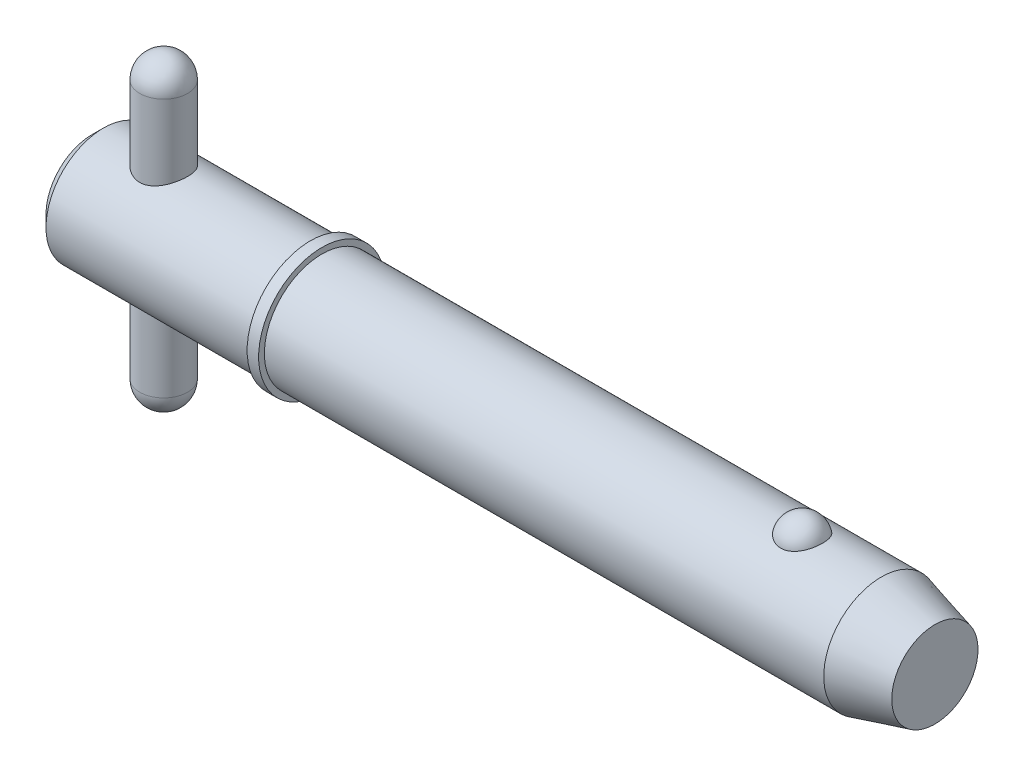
ISO-10303-21;
HEADER;
FILE_DESCRIPTION(('STEP AP214'),'2;1');
FILE_NAME('part.step','',(''),(''),'','','');
FILE_SCHEMA(('AUTOMOTIVE_DESIGN { 1 0 10303 214 1 1 1 1 }'));
ENDSEC;
DATA;
#1=APPLICATION_CONTEXT('core data for automotive mechanical design processes');
#2=APPLICATION_PROTOCOL_DEFINITION('international standard','automotive_design',2000,#1);
#3=PRODUCT_CONTEXT('',#1,'mechanical');
#4=PRODUCT('Part','Part','',(#3));
#5=PRODUCT_RELATED_PRODUCT_CATEGORY('part','',(#4));
#6=PRODUCT_DEFINITION_FORMATION('','',#4);
#7=PRODUCT_DEFINITION_CONTEXT('part definition',#1,'design');
#8=PRODUCT_DEFINITION('design','',#6,#7);
#9=PRODUCT_DEFINITION_SHAPE('','',#8);
#10=(LENGTH_UNIT() NAMED_UNIT(*) SI_UNIT(.MILLI.,.METRE.));
#11=(NAMED_UNIT(*) PLANE_ANGLE_UNIT() SI_UNIT($,.RADIAN.));
#12=(NAMED_UNIT(*) SI_UNIT($,.STERADIAN.) SOLID_ANGLE_UNIT());
#13=UNCERTAINTY_MEASURE_WITH_UNIT(LENGTH_MEASURE(1.E-05),#10,'distance_accuracy_value','');
#14=(GEOMETRIC_REPRESENTATION_CONTEXT(3) GLOBAL_UNCERTAINTY_ASSIGNED_CONTEXT((#13)) GLOBAL_UNIT_ASSIGNED_CONTEXT((#10,
#11,#12)) REPRESENTATION_CONTEXT('',''));
#15=CARTESIAN_POINT('',(0.,0.,0.));
#16=DIRECTION('',(0.,0.,1.));
#17=DIRECTION('',(1.,0.,0.));
#18=AXIS2_PLACEMENT_3D('',#15,#16,#17);
#19=CARTESIAN_POINT('',(5.94,12.7,0.));
#20=DIRECTION('',(0.,-1.,0.));
#21=DIRECTION('',(0.,0.,-1.));
#22=AXIS2_PLACEMENT_3D('',#19,#20,#21);
#23=CYLINDRICAL_SURFACE('',#22,1.98);
#24=CARTESIAN_POINT('',(5.94,-10.72,0.));
#25=DIRECTION('',(0.,-1.,0.));
#26=DIRECTION('',(0.,0.,-1.));
#27=AXIS2_PLACEMENT_3D('',#24,#25,#26);
#28=CIRCLE('',#27,1.98);
#29=CARTESIAN_POINT('',(5.94,-10.72,-1.98));
#30=VERTEX_POINT('',#29);
#31=EDGE_CURVE('P0_E10',#30,#30,#28,.F.);
#32=ORIENTED_EDGE('',*,*,#31,.T.);
#33=EDGE_LOOP('',(#32));
#34=FACE_BOUND('',#33,.T.);
#35=CARTESIAN_POINT('',(5.94,10.72,0.));
#36=DIRECTION('',(0.,-1.,0.));
#37=DIRECTION('',(0.,0.,-1.));
#38=AXIS2_PLACEMENT_3D('',#35,#36,#37);
#39=CIRCLE('',#38,1.98);
#40=CARTESIAN_POINT('',(5.94,10.72,-1.98));
#41=VERTEX_POINT('',#40);
#42=EDGE_CURVE('P0_E21',#41,#41,#39,.T.);
#43=ORIENTED_EDGE('',*,*,#42,.T.);
#44=EDGE_LOOP('',(#43));
#45=FACE_BOUND('',#44,.T.);
#46=ADVANCED_FACE('P0_F14',(#34,#45),#23,.T.);
#47=CARTESIAN_POINT('',(5.94,-10.72,0.));
#48=DIRECTION('',(0.,0.,1.));
#49=DIRECTION('',(1.,0.,0.));
#50=AXIS2_PLACEMENT_3D('',#47,#48,#49);
#51=SPHERICAL_SURFACE('',#50,1.98);
#52=CARTESIAN_POINT('',(5.94,-10.72,0.));
#53=DIRECTION('',(0.,-1.,0.));
#54=DIRECTION('',(0.,0.,-1.));
#55=AXIS2_PLACEMENT_3D('',#52,#53,#54);
#56=SPHERICAL_SURFACE('',#55,1.98);
#57=ORIENTED_EDGE('',*,*,#31,.F.);
#58=EDGE_LOOP('',(#57));
#59=FACE_BOUND('',#58,.T.);
#60=ADVANCED_FACE('P0_F29',(#59),#56,.T.);
#61=CARTESIAN_POINT('',(5.94,10.72,0.));
#62=DIRECTION('',(0.,0.,1.));
#63=DIRECTION('',(1.,0.,0.));
#64=AXIS2_PLACEMENT_3D('',#61,#62,#63);
#65=SPHERICAL_SURFACE('',#64,1.98);
#66=CARTESIAN_POINT('',(5.94,10.72,0.));
#67=DIRECTION('',(0.,-1.,0.));
#68=DIRECTION('',(0.,0.,-1.));
#69=AXIS2_PLACEMENT_3D('',#66,#67,#68);
#70=SPHERICAL_SURFACE('',#69,1.98);
#71=ORIENTED_EDGE('',*,*,#42,.F.);
#72=EDGE_LOOP('',(#71));
#73=FACE_BOUND('',#72,.T.);
#74=ADVANCED_FACE('P0_F16',(#73),#70,.T.);
#75=CLOSED_SHELL('',(#46,#60,#74));
#76=MANIFOLD_SOLID_BREP('P0_B1',#75);
#77=CARTESIAN_POINT('',(0.,0.,0.));
#78=DIRECTION('',(1.,0.,0.));
#79=DIRECTION('',(0.,0.,-1.));
#80=AXIS2_PLACEMENT_3D('',#77,#78,#79);
#81=CYLINDRICAL_SURFACE('',#80,4.765);
#82=CARTESIAN_POINT('',(65.4041944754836,0.,0.));
#83=DIRECTION('',(1.,0.,0.));
#84=DIRECTION('',(0.,0.,-1.));
#85=AXIS2_PLACEMENT_3D('',#82,#83,#84);
#86=CIRCLE('',#85,4.765);
#87=CARTESIAN_POINT('',(65.4041944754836,0.,-4.765));
#88=VERTEX_POINT('',#87);
#89=EDGE_CURVE('P1_E81',#88,#88,#86,.T.);
#90=ORIENTED_EDGE('',*,*,#89,.F.);
#91=EDGE_LOOP('',(#90));
#92=FACE_BOUND('',#91,.T.);
#93=CARTESIAN_POINT('',(19.05,0.,0.));
#94=DIRECTION('',(1.,0.,0.));
#95=DIRECTION('',(0.,0.,-1.));
#96=AXIS2_PLACEMENT_3D('',#93,#94,#95);
#97=CIRCLE('',#96,4.765);
#98=CARTESIAN_POINT('',(19.05,0.,-4.765));
#99=VERTEX_POINT('',#98);
#100=EDGE_CURVE('P1_E85',#99,#99,#97,.T.);
#101=ORIENTED_EDGE('',*,*,#100,.T.);
#102=EDGE_LOOP('',(#101));
#103=FACE_BOUND('',#102,.T.);
#104=CARTESIAN_POINT('',(58.851020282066,4.42764777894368,1.76101111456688));
#105=CARTESIAN_POINT('',(58.7597212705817,4.42764470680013,1.76101422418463));
#106=CARTESIAN_POINT('',(58.6684468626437,4.43059091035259,1.75366340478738));
#107=CARTESIAN_POINT('',(58.4886154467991,4.44201846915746,1.72451180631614));
#108=CARTESIAN_POINT('',(58.4000577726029,4.45049845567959,1.70271460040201));
#109=CARTESIAN_POINT('',(58.2282570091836,4.47200516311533,1.64539370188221));
#110=CARTESIAN_POINT('',(58.1450064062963,4.48502527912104,1.60988994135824));
#111=CARTESIAN_POINT('',(57.9857633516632,4.51419542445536,1.52617873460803));
#112=CARTESIAN_POINT('',(57.9097723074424,4.53034605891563,1.47796883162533));
#113=CARTESIAN_POINT('',(57.7647445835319,4.5645931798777,1.36860494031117));
#114=CARTESIAN_POINT('',(57.6959645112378,4.58273170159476,1.3071242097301));
#115=CARTESIAN_POINT('',(57.5693423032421,4.61870302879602,1.17370204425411));
#116=CARTESIAN_POINT('',(57.5115021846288,4.63653577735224,1.10175868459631));
#117=CARTESIAN_POINT('',(57.4055709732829,4.67090140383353,0.945806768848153));
#118=CARTESIAN_POINT('',(57.3580305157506,4.68734068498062,0.861402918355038));
#119=CARTESIAN_POINT('',(57.2770817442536,4.71628466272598,0.685442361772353));
#120=CARTESIAN_POINT('',(57.2436747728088,4.72878898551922,0.593884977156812));
#121=CARTESIAN_POINT('',(57.191287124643,4.74874061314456,0.404781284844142));
#122=CARTESIAN_POINT('',(57.1725178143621,4.75611366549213,0.307168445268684));
#123=CARTESIAN_POINT('',(57.1505846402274,4.76475393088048,0.109940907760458));
#124=CARTESIAN_POINT('',(57.1474205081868,4.76602124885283,0.0103262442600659));
#125=CARTESIAN_POINT('',(57.1567405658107,4.76232928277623,-0.187629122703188));
#126=CARTESIAN_POINT('',(57.1691588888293,4.7573962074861,-0.285973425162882));
#127=CARTESIAN_POINT('',(57.2092804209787,4.74184975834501,-0.479027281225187));
#128=CARTESIAN_POINT('',(57.2369839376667,4.7312362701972,-0.573736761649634));
#129=CARTESIAN_POINT('',(57.3071581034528,4.70540026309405,-0.756973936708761));
#130=CARTESIAN_POINT('',(57.3496460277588,4.69017235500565,-0.845494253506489));
#131=CARTESIAN_POINT('',(57.448520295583,4.6566986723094,-1.01378033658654));
#132=CARTESIAN_POINT('',(57.5049076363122,4.63845268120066,-1.09354547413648));
#133=CARTESIAN_POINT('',(57.630552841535,4.60085438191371,-1.24228523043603));
#134=CARTESIAN_POINT('',(57.6998439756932,4.58149930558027,-1.31123108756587));
#135=CARTESIAN_POINT('',(57.8496066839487,4.54391653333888,-1.43607409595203));
#136=CARTESIAN_POINT('',(57.9300771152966,4.52568872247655,-1.49197257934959));
#137=CARTESIAN_POINT('',(58.0981500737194,4.49293007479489,-1.58786764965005));
#138=CARTESIAN_POINT('',(58.1855445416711,4.47832346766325,-1.62820219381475));
#139=CARTESIAN_POINT('',(58.366553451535,4.45406011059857,-1.69345757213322));
#140=CARTESIAN_POINT('',(58.4601655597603,4.44440151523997,-1.71838415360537));
#141=CARTESIAN_POINT('',(58.6458939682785,4.43159888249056,-1.75112843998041));
#142=CARTESIAN_POINT('',(58.737849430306,4.42815213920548,-1.75974223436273));
#143=CARTESIAN_POINT('',(58.9219658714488,4.427247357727,-1.76201865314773));
#144=CARTESIAN_POINT('',(59.0141268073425,4.42978816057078,-1.7556841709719));
#145=CARTESIAN_POINT('',(59.1931292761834,4.4403864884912,-1.72869560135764));
#146=CARTESIAN_POINT('',(59.2800474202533,4.44827555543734,-1.70847853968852));
#147=CARTESIAN_POINT('',(59.4491314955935,4.46852246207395,-1.65479562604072));
#148=CARTESIAN_POINT('',(59.5312970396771,4.48088066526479,-1.62132869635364));
#149=CARTESIAN_POINT('',(59.6905916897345,4.50907357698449,-1.54120560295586));
#150=CARTESIAN_POINT('',(59.7675700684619,4.52497884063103,-1.49427526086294));
#151=CARTESIAN_POINT('',(59.9127080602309,4.55845148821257,-1.38881222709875));
#152=CARTESIAN_POINT('',(59.9808656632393,4.57601924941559,-1.33027689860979));
#153=CARTESIAN_POINT('',(60.1100990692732,4.61196537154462,-1.19991049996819));
#154=CARTESIAN_POINT('',(60.1706562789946,4.63034074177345,-1.12756415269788));
#155=CARTESIAN_POINT('',(60.2792797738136,4.66513959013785,-0.973612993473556));
#156=CARTESIAN_POINT('',(60.3273438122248,4.68156271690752,-0.8920065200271));
#157=CARTESIAN_POINT('',(60.411383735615,4.71130224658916,-0.718892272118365));
#158=CARTESIAN_POINT('',(60.4469185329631,4.724501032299,-0.627149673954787));
#159=CARTESIAN_POINT('',(60.5029522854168,4.74571823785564,-0.438611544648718));
#160=CARTESIAN_POINT('',(60.523450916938,4.75373654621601,-0.341815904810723));
#161=CARTESIAN_POINT('',(60.5490338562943,4.76378905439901,-0.145633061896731));
#162=CARTESIAN_POINT('',(60.554076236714,4.76580697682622,-0.046239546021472));
#163=CARTESIAN_POINT('',(60.5485239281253,4.76360573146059,0.15203857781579));
#164=CARTESIAN_POINT('',(60.5379294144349,4.75938663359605,0.250923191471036));
#165=CARTESIAN_POINT('',(60.5013875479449,4.74516937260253,0.445004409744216));
#166=CARTESIAN_POINT('',(60.4754964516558,4.73519238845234,0.540213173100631));
#167=CARTESIAN_POINT('',(60.4089273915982,4.7104939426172,0.724662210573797));
#168=CARTESIAN_POINT('',(60.368248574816,4.69577220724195,0.81390214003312));
#169=CARTESIAN_POINT('',(60.2727177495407,4.66303767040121,0.984313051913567));
#170=CARTESIAN_POINT('',(60.2178042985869,4.64501070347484,1.06544688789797));
#171=CARTESIAN_POINT('',(60.0950496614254,4.60764678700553,1.21692673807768));
#172=CARTESIAN_POINT('',(60.0272086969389,4.58830985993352,1.2872729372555));
#173=CARTESIAN_POINT('',(59.8805480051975,4.55060370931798,1.41479271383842));
#174=CARTESIAN_POINT('',(59.8017918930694,4.53222967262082,1.47203785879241));
#175=CARTESIAN_POINT('',(59.6349890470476,4.49849576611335,1.57212016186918));
#176=CARTESIAN_POINT('',(59.5469417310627,4.48313608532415,1.61495641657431));
#177=CARTESIAN_POINT('',(59.3597918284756,4.45676184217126,1.68642657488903));
#178=CARTESIAN_POINT('',(59.2603653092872,4.44598302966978,1.71430590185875));
#179=CARTESIAN_POINT('',(59.0576210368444,4.43142918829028,1.7515925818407));
#180=CARTESIAN_POINT('',(58.9543049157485,4.42765125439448,1.76100759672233));
#181=CARTESIAN_POINT('',(58.851020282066,4.42764777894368,1.76101111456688));
#182=B_SPLINE_CURVE_WITH_KNOTS('',3,(#104,#105,#106,#107,#108,#109,#110,#111,#112,#113,#114,
#115,#116,#117,#118,#119,#120,#121,#122,#123,#124,#125,#126,#127,#128,#129,#130,#131,#132,#133,
#134,#135,#136,#137,#138,#139,#140,#141,#142,#143,#144,#145,#146,#147,#148,#149,#150,#151,#152,
#153,#154,#155,#156,#157,#158,#159,#160,#161,#162,#163,#164,#165,#166,#167,#168,#169,#170,#171,
#172,#173,#174,#175,#176,#177,#178,#179,#180,#181),.UNSPECIFIED.,.T.,.F.,(4,2,2,2,2,2,2,2,2,2,2,
2,2,2,2,2,2,2,2,2,2,2,2,2,2,2,2,2,2,2,2,2,2,2,2,2,2,2,4),(0.,0.273517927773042,
0.546968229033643,0.820022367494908,1.09312934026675,1.37393946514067,1.65480131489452,
1.94820420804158,2.24163496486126,2.53922817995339,2.8368162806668,3.13315071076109,
3.42949110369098,3.72617893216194,4.02288805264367,4.32037303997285,4.61782764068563,
4.90840095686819,5.19886582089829,5.4747485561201,5.75057789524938,6.01809977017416,
6.28564340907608,6.55907787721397,6.83257454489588,7.11962987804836,7.40673679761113,
7.70312663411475,7.99952284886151,8.29672237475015,8.59391856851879,8.89002850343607,
9.18615552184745,9.483582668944,9.78100471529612,10.0767610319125,10.3725358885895,
10.6820893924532,10.991514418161),.UNSPECIFIED.);
#183=CARTESIAN_POINT('',(58.851020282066,4.42764777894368,1.76101111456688));
#184=VERTEX_POINT('',#183);
#185=EDGE_CURVE('P1_E35',#184,#184,#182,.T.);
#186=ORIENTED_EDGE('',*,*,#185,.T.);
#187=EDGE_LOOP('',(#186));
#188=FACE_BOUND('',#187,.T.);
#189=ADVANCED_FACE('P1_F13',(#92,#103,#188),#81,.T.);
#190=CARTESIAN_POINT('',(0.,0.,0.));
#191=DIRECTION('',(-1.,0.,0.));
#192=DIRECTION('',(0.,0.,1.));
#193=AXIS2_PLACEMENT_3D('',#190,#191,#192);
#194=PLANE('',#193);
#195=CARTESIAN_POINT('',(0.,0.,0.));
#196=DIRECTION('',(1.,0.,0.));
#197=DIRECTION('',(0.,0.,-1.));
#198=AXIS2_PLACEMENT_3D('',#195,#196,#197);
#199=CIRCLE('',#198,3.812);
#200=CARTESIAN_POINT('',(0.,0.,-3.812));
#201=VERTEX_POINT('',#200);
#202=EDGE_CURVE('P1_E9',#201,#201,#199,.T.);
#203=ORIENTED_EDGE('',*,*,#202,.F.);
#204=EDGE_LOOP('',(#203));
#205=FACE_BOUND('',#204,.T.);
#206=ADVANCED_FACE('P1_F15',(#205),#194,.T.);
#207=CARTESIAN_POINT('',(0.952999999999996,0.,0.));
#208=DIRECTION('',(1.,0.,0.));
#209=DIRECTION('',(0.,0.,-1.));
#210=AXIS2_PLACEMENT_3D('',#207,#208,#209);
#211=CONICAL_SURFACE('',#210,4.765,0.78539816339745);
#212=ORIENTED_EDGE('',*,*,#202,.T.);
#213=EDGE_LOOP('',(#212));
#214=FACE_BOUND('',#213,.T.);
#215=CARTESIAN_POINT('',(0.952999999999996,0.,0.));
#216=DIRECTION('',(1.,0.,0.));
#217=DIRECTION('',(0.,0.,-1.));
#218=AXIS2_PLACEMENT_3D('',#215,#216,#217);
#219=CIRCLE('',#218,4.765);
#220=CARTESIAN_POINT('',(0.952999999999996,0.,-4.765));
#221=VERTEX_POINT('',#220);
#222=EDGE_CURVE('P1_E26',#221,#221,#219,.T.);
#223=ORIENTED_EDGE('',*,*,#222,.F.);
#224=EDGE_LOOP('',(#223));
#225=FACE_BOUND('',#224,.T.);
#226=ADVANCED_FACE('P1_F77',(#214,#225),#211,.T.);
#227=CARTESIAN_POINT('',(0.,0.,0.));
#228=DIRECTION('',(1.,0.,0.));
#229=DIRECTION('',(0.,0.,-1.));
#230=AXIS2_PLACEMENT_3D('',#227,#228,#229);
#231=CYLINDRICAL_SURFACE('',#230,4.765);
#232=CARTESIAN_POINT('',(5.94,-4.33414639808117,1.98));
#233=CARTESIAN_POINT('',(5.83435484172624,-4.33415447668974,1.97999169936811));
#234=CARTESIAN_POINT('',(5.72854887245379,-4.33806396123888,1.97149330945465));
#235=CARTESIAN_POINT('',(5.51998191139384,-4.35319906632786,1.93783487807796));
#236=CARTESIAN_POINT('',(5.41723000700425,-4.3644446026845,1.91262947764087));
#237=CARTESIAN_POINT('',(5.21817294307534,-4.39274225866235,1.84670269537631));
#238=CARTESIAN_POINT('',(5.12184344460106,-4.40977076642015,1.80604432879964));
#239=CARTESIAN_POINT('',(4.93740039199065,-4.44768106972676,1.71055160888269));
#240=CARTESIAN_POINT('',(4.84928487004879,-4.46856193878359,1.65572066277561));
#241=CARTESIAN_POINT('',(4.67826533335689,-4.51326966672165,1.52981120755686));
#242=CARTESIAN_POINT('',(4.59593118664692,-4.53719608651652,1.45799365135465));
#243=CARTESIAN_POINT('',(4.44405452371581,-4.58448035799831,1.30170177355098));
#244=CARTESIAN_POINT('',(4.37451692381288,-4.60783798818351,1.21722260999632));
#245=CARTESIAN_POINT('',(4.24730683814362,-4.65256187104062,1.03353484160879));
#246=CARTESIAN_POINT('',(4.19027484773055,-4.67379892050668,0.933848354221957));
#247=CARTESIAN_POINT('',(4.0940363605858,-4.7106711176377,0.7252544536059));
#248=CARTESIAN_POINT('',(4.05482199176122,-4.72630873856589,0.61635113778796));
#249=CARTESIAN_POINT('',(3.99739515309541,-4.74951416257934,0.398397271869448));
#250=CARTESIAN_POINT('',(3.97820018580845,-4.7574579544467,0.289646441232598));
#251=CARTESIAN_POINT('',(3.95818309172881,-4.76574596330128,0.0701967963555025));
#252=CARTESIAN_POINT('',(3.95735355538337,-4.76609324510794,-0.0405012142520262));
#253=CARTESIAN_POINT('',(3.9735743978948,-4.75937098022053,-0.253561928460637));
#254=CARTESIAN_POINT('',(3.98954548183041,-4.75274912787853,-0.356023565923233));
#255=CARTESIAN_POINT('',(4.03706504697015,-4.73344665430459,-0.556659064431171));
#256=CARTESIAN_POINT('',(4.06861467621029,-4.72076558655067,-0.654832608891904));
#257=CARTESIAN_POINT('',(4.14677192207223,-4.69032846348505,-0.845904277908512));
#258=CARTESIAN_POINT('',(4.19360181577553,-4.67249797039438,-0.938699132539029));
#259=CARTESIAN_POINT('',(4.30077315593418,-4.63350852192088,-1.11535616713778));
#260=CARTESIAN_POINT('',(4.3611193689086,-4.61234839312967,-1.19921518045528));
#261=CARTESIAN_POINT('',(4.49853487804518,-4.56707259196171,-1.3618711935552));
#262=CARTESIAN_POINT('',(4.57648039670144,-4.5428537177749,-1.43990029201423));
#263=CARTESIAN_POINT('',(4.74440779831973,-4.49530722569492,-1.58211009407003));
#264=CARTESIAN_POINT('',(4.83439425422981,-4.47197995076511,-1.64628551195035));
#265=CARTESIAN_POINT('',(5.02755026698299,-4.42812342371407,-1.76092221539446));
#266=CARTESIAN_POINT('',(5.13105348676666,-4.40770990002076,-1.81086937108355));
#267=CARTESIAN_POINT('',(5.34607555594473,-4.37336901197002,-1.89231211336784));
#268=CARTESIAN_POINT('',(5.45758864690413,-4.3594370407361,-1.92382080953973));
#269=CARTESIAN_POINT('',(5.67777275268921,-4.34077746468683,-1.96554536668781));
#270=CARTESIAN_POINT('',(5.78616167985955,-4.33551319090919,-1.9770057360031));
#271=CARTESIAN_POINT('',(6.00341835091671,-4.33325118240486,-1.98196183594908));
#272=CARTESIAN_POINT('',(6.11228591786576,-4.33625061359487,-1.97546372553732));
#273=CARTESIAN_POINT('',(6.32012423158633,-4.34962383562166,-1.94582288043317));
#274=CARTESIAN_POINT('',(6.41928436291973,-4.35951709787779,-1.92376364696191));
#275=CARTESIAN_POINT('',(6.61241543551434,-4.38495043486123,-1.86506038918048));
#276=CARTESIAN_POINT('',(6.70638516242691,-4.40049182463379,-1.82841296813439));
#277=CARTESIAN_POINT('',(6.89090272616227,-4.43627016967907,-1.73985559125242));
#278=CARTESIAN_POINT('',(6.98113841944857,-4.45667771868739,-1.68736639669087));
#279=CARTESIAN_POINT('',(7.1519532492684,-4.49964530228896,-1.56919282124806));
#280=CARTESIAN_POINT('',(7.232528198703,-4.52220626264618,-1.50350275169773));
#281=CARTESIAN_POINT('',(7.38851617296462,-4.56914071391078,-1.35452895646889));
#282=CARTESIAN_POINT('',(7.46298462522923,-4.5935132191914,-1.27025197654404));
#283=CARTESIAN_POINT('',(7.59689029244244,-4.63962841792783,-1.08983181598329));
#284=CARTESIAN_POINT('',(7.65632644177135,-4.66137092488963,-0.993687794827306));
#285=CARTESIAN_POINT('',(7.75840361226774,-4.69991192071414,-0.791608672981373));
#286=CARTESIAN_POINT('',(7.80100481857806,-4.71669866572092,-0.685651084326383));
#287=CARTESIAN_POINT('',(7.86746997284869,-4.74331408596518,-0.467197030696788));
#288=CARTESIAN_POINT('',(7.8913450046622,-4.75314687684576,-0.354704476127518));
#289=CARTESIAN_POINT('',(7.91828971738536,-4.76427543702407,-0.134819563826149));
#290=CARTESIAN_POINT('',(7.92269147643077,-4.76611762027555,-0.027616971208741));
#291=CARTESIAN_POINT('',(7.91414154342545,-4.76256684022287,0.185959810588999));
#292=CARTESIAN_POINT('',(7.90119286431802,-4.75717513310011,0.292334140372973));
#293=CARTESIAN_POINT('',(7.85926572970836,-4.74004856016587,0.497383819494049));
#294=CARTESIAN_POINT('',(7.83086647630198,-4.72854322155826,0.596198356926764));
#295=CARTESIAN_POINT('',(7.75947503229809,-4.70045111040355,0.787624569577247));
#296=CARTESIAN_POINT('',(7.71648006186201,-4.68386336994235,0.880235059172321));
#297=CARTESIAN_POINT('',(7.6149456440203,-4.64628321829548,1.06122875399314));
#298=CARTESIAN_POINT('',(7.55579211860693,-4.62512577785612,1.14923242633));
#299=CARTESIAN_POINT('',(7.42451813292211,-4.58091700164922,1.31443888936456));
#300=CARTESIAN_POINT('',(7.35239289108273,-4.5578649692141,1.39163767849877));
#301=CARTESIAN_POINT('',(7.19146107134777,-4.51050832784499,1.53847013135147));
#302=CARTESIAN_POINT('',(7.10185635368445,-4.48622440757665,1.60723941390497));
#303=CARTESIAN_POINT('',(6.91164948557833,-4.44076541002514,1.72888900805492));
#304=CARTESIAN_POINT('',(6.81104124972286,-4.41959206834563,1.78176046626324));
#305=CARTESIAN_POINT('',(6.60181953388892,-4.38318936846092,1.86953227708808));
#306=CARTESIAN_POINT('',(6.49325511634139,-4.3679267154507,1.90453365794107));
#307=CARTESIAN_POINT('',(6.32681512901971,-4.35102038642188,1.94268459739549));
#308=CARTESIAN_POINT('',(6.27079191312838,-4.34638447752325,1.953006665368));
#309=CARTESIAN_POINT('',(6.15793999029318,-4.33925923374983,1.96879053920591));
#310=CARTESIAN_POINT('',(6.10111188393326,-4.33676837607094,1.97425579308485));
#311=CARTESIAN_POINT('',(6.00947316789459,-4.33456308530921,1.97908711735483));
#312=CARTESIAN_POINT('',(5.97474528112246,-4.33414374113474,1.98000272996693));
#313=CARTESIAN_POINT('',(5.94,-4.33414639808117,1.98));
#314=B_SPLINE_CURVE_WITH_KNOTS('',3,(#232,#233,#234,#235,#236,#237,#238,#239,#240,#241,#242,
#243,#244,#245,#246,#247,#248,#249,#250,#251,#252,#253,#254,#255,#256,#257,#258,#259,#260,#261,
#262,#263,#264,#265,#266,#267,#268,#269,#270,#271,#272,#273,#274,#275,#276,#277,#278,#279,#280,
#281,#282,#283,#284,#285,#286,#287,#288,#289,#290,#291,#292,#293,#294,#295,#296,#297,#298,#299,
#300,#301,#302,#303,#304,#305,#306,#307,#308,#309,#310,#311,#312,#313),.UNSPECIFIED.,.T.,.F.,(4,
2,2,2,2,2,2,2,2,2,2,2,2,2,2,2,2,2,2,2,2,2,2,2,2,2,2,2,2,2,2,2,2,2,2,2,2,2,2,2,4),(0.,
0.316814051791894,0.634491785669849,0.950887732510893,1.2672076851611,1.60127705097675,
1.93547449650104,2.28407463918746,2.63252061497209,2.96292077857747,3.29318763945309,
3.60346227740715,3.91375978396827,4.22878888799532,4.54392926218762,4.88117914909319,
5.21855748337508,5.56691259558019,5.91501972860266,6.24062939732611,6.56612741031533,
6.87094948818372,7.17584258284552,7.49361276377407,7.81152017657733,8.15513975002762,
8.4987836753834,8.8432355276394,9.18748334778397,9.50777781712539,9.8280166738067,
10.1370037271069,10.4460496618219,10.7690461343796,11.0921619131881,11.4371238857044,
11.7822776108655,12.1254577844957,12.2967183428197,12.4678572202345,12.5720531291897),.UNSPECIFIED.);
#315=CARTESIAN_POINT('',(5.94,-4.33414639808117,1.98));
#316=VERTEX_POINT('',#315);
#317=EDGE_CURVE('P1_E17',#316,#316,#314,.T.);
#318=ORIENTED_EDGE('',*,*,#317,.F.);
#319=EDGE_LOOP('',(#318));
#320=FACE_BOUND('',#319,.T.);
#321=CARTESIAN_POINT('',(5.94,4.33414639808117,1.98));
#322=CARTESIAN_POINT('',(6.04564515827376,4.33415447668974,1.97999169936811));
#323=CARTESIAN_POINT('',(6.15145112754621,4.33806396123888,1.97149330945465));
#324=CARTESIAN_POINT('',(6.36001808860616,4.35319906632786,1.93783487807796));
#325=CARTESIAN_POINT('',(6.46276999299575,4.3644446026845,1.91262947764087));
#326=CARTESIAN_POINT('',(6.66182705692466,4.39274225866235,1.84670269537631));
#327=CARTESIAN_POINT('',(6.75815655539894,4.40977076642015,1.80604432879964));
#328=CARTESIAN_POINT('',(6.94259960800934,4.44768106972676,1.71055160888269));
#329=CARTESIAN_POINT('',(7.03071512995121,4.46856193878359,1.65572066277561));
#330=CARTESIAN_POINT('',(7.20173466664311,4.51326966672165,1.52981120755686));
#331=CARTESIAN_POINT('',(7.28406881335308,4.53719608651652,1.45799365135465));
#332=CARTESIAN_POINT('',(7.43594547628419,4.58448035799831,1.30170177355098));
#333=CARTESIAN_POINT('',(7.50548307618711,4.60783798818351,1.21722260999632));
#334=CARTESIAN_POINT('',(7.63269316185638,4.65256187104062,1.03353484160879));
#335=CARTESIAN_POINT('',(7.68972515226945,4.67379892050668,0.933848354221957));
#336=CARTESIAN_POINT('',(7.7859636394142,4.7106711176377,0.7252544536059));
#337=CARTESIAN_POINT('',(7.82517800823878,4.72630873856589,0.61635113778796));
#338=CARTESIAN_POINT('',(7.88260484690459,4.74951416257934,0.398397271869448));
#339=CARTESIAN_POINT('',(7.90179981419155,4.7574579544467,0.289646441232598));
#340=CARTESIAN_POINT('',(7.92181690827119,4.76574596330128,0.0701967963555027));
#341=CARTESIAN_POINT('',(7.92264644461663,4.76609324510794,-0.040501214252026));
#342=CARTESIAN_POINT('',(7.9064256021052,4.75937098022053,-0.253561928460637));
#343=CARTESIAN_POINT('',(7.89045451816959,4.75274912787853,-0.356023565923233));
#344=CARTESIAN_POINT('',(7.84293495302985,4.73344665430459,-0.55665906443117));
#345=CARTESIAN_POINT('',(7.81138532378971,4.72076558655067,-0.654832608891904));
#346=CARTESIAN_POINT('',(7.73322807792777,4.69032846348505,-0.845904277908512));
#347=CARTESIAN_POINT('',(7.68639818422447,4.67249797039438,-0.938699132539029));
#348=CARTESIAN_POINT('',(7.57922684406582,4.63350852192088,-1.11535616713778));
#349=CARTESIAN_POINT('',(7.5188806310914,4.61234839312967,-1.19921518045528));
#350=CARTESIAN_POINT('',(7.38146512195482,4.56707259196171,-1.3618711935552));
#351=CARTESIAN_POINT('',(7.30351960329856,4.5428537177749,-1.43990029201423));
#352=CARTESIAN_POINT('',(7.13559220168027,4.49530722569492,-1.58211009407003));
#353=CARTESIAN_POINT('',(7.04560574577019,4.47197995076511,-1.64628551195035));
#354=CARTESIAN_POINT('',(6.85244973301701,4.42812342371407,-1.76092221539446));
#355=CARTESIAN_POINT('',(6.74894651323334,4.40770990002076,-1.81086937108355));
#356=CARTESIAN_POINT('',(6.53392444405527,4.37336901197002,-1.89231211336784));
#357=CARTESIAN_POINT('',(6.42241135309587,4.3594370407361,-1.92382080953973));
#358=CARTESIAN_POINT('',(6.20222724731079,4.34077746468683,-1.96554536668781));
#359=CARTESIAN_POINT('',(6.09383832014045,4.33551319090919,-1.9770057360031));
#360=CARTESIAN_POINT('',(5.87658164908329,4.33325118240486,-1.98196183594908));
#361=CARTESIAN_POINT('',(5.76771408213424,4.33625061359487,-1.97546372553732));
#362=CARTESIAN_POINT('',(5.55987576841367,4.34962383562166,-1.94582288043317));
#363=CARTESIAN_POINT('',(5.46071563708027,4.35951709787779,-1.92376364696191));
#364=CARTESIAN_POINT('',(5.26758456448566,4.38495043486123,-1.86506038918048));
#365=CARTESIAN_POINT('',(5.17361483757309,4.40049182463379,-1.82841296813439));
#366=CARTESIAN_POINT('',(4.98909727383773,4.43627016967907,-1.73985559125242));
#367=CARTESIAN_POINT('',(4.89886158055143,4.45667771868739,-1.68736639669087));
#368=CARTESIAN_POINT('',(4.72804675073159,4.49964530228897,-1.56919282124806));
#369=CARTESIAN_POINT('',(4.647471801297,4.52220626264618,-1.50350275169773));
#370=CARTESIAN_POINT('',(4.49148382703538,4.56914071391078,-1.35452895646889));
#371=CARTESIAN_POINT('',(4.41701537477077,4.5935132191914,-1.27025197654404));
#372=CARTESIAN_POINT('',(4.28310970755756,4.63962841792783,-1.08983181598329));
#373=CARTESIAN_POINT('',(4.22367355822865,4.66137092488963,-0.993687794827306));
#374=CARTESIAN_POINT('',(4.12159638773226,4.69991192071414,-0.791608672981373));
#375=CARTESIAN_POINT('',(4.07899518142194,4.71669866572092,-0.685651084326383));
#376=CARTESIAN_POINT('',(4.01253002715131,4.74331408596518,-0.467197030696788));
#377=CARTESIAN_POINT('',(3.98865499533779,4.75314687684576,-0.354704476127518));
#378=CARTESIAN_POINT('',(3.96171028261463,4.76427543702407,-0.134819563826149));
#379=CARTESIAN_POINT('',(3.95730852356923,4.76611762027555,-0.0276169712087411));
#380=CARTESIAN_POINT('',(3.96585845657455,4.76256684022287,0.185959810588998));
#381=CARTESIAN_POINT('',(3.97880713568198,4.75717513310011,0.292334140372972));
#382=CARTESIAN_POINT('',(4.02073427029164,4.74004856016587,0.497383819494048));
#383=CARTESIAN_POINT('',(4.04913352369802,4.72854322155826,0.596198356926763));
#384=CARTESIAN_POINT('',(4.12052496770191,4.70045111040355,0.787624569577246));
#385=CARTESIAN_POINT('',(4.16351993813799,4.68386336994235,0.880235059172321));
#386=CARTESIAN_POINT('',(4.2650543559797,4.64628321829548,1.06122875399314));
#387=CARTESIAN_POINT('',(4.32420788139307,4.62512577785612,1.14923242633));
#388=CARTESIAN_POINT('',(4.45548186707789,4.58091700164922,1.31443888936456));
#389=CARTESIAN_POINT('',(4.52760710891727,4.5578649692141,1.39163767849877));
#390=CARTESIAN_POINT('',(4.68853892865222,4.51050832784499,1.53847013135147));
#391=CARTESIAN_POINT('',(4.77814364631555,4.48622440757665,1.60723941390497));
#392=CARTESIAN_POINT('',(4.96835051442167,4.44076541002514,1.72888900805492));
#393=CARTESIAN_POINT('',(5.06895875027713,4.41959206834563,1.78176046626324));
#394=CARTESIAN_POINT('',(5.27818046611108,4.38318936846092,1.86953227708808));
#395=CARTESIAN_POINT('',(5.38674488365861,4.3679267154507,1.90453365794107));
#396=CARTESIAN_POINT('',(5.55318487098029,4.35102038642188,1.94268459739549));
#397=CARTESIAN_POINT('',(5.60920808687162,4.34638447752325,1.953006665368));
#398=CARTESIAN_POINT('',(5.72206000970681,4.33925923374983,1.96879053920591));
#399=CARTESIAN_POINT('',(5.77888811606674,4.33676837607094,1.97425579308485));
#400=CARTESIAN_POINT('',(5.87052683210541,4.33456308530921,1.97908711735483));
#401=CARTESIAN_POINT('',(5.90525471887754,4.33414374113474,1.98000272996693));
#402=CARTESIAN_POINT('',(5.94,4.33414639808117,1.98));
#403=B_SPLINE_CURVE_WITH_KNOTS('',3,(#321,#322,#323,#324,#325,#326,#327,#328,#329,#330,#331,
#332,#333,#334,#335,#336,#337,#338,#339,#340,#341,#342,#343,#344,#345,#346,#347,#348,#349,#350,
#351,#352,#353,#354,#355,#356,#357,#358,#359,#360,#361,#362,#363,#364,#365,#366,#367,#368,#369,
#370,#371,#372,#373,#374,#375,#376,#377,#378,#379,#380,#381,#382,#383,#384,#385,#386,#387,#388,
#389,#390,#391,#392,#393,#394,#395,#396,#397,#398,#399,#400,#401,#402),.UNSPECIFIED.,.T.,.F.,(4,
2,2,2,2,2,2,2,2,2,2,2,2,2,2,2,2,2,2,2,2,2,2,2,2,2,2,2,2,2,2,2,2,2,2,2,2,2,2,2,4),(0.,
0.316814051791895,0.634491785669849,0.950887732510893,1.2672076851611,1.60127705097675,
1.93547449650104,2.28407463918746,2.63252061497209,2.96292077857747,3.29318763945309,
3.60346227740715,3.91375978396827,4.22878888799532,4.54392926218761,4.88117914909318,
5.21855748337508,5.56691259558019,5.91501972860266,6.24062939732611,6.56612741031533,
6.87094948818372,7.17584258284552,7.49361276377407,7.81152017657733,8.15513975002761,
8.4987836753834,8.84323552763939,9.18748334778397,9.50777781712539,9.8280166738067,
10.1370037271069,10.4460496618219,10.7690461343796,11.0921619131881,11.4371238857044,
11.7822776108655,12.1254577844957,12.2967183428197,12.4678572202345,12.5720531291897),.UNSPECIFIED.);
#404=CARTESIAN_POINT('',(5.94,4.33414639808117,1.98));
#405=VERTEX_POINT('',#404);
#406=EDGE_CURVE('P1_E43',#405,#405,#403,.T.);
#407=ORIENTED_EDGE('',*,*,#406,.F.);
#408=EDGE_LOOP('',(#407));
#409=FACE_BOUND('',#408,.T.);
#410=ORIENTED_EDGE('',*,*,#222,.T.);
#411=EDGE_LOOP('',(#410));
#412=FACE_BOUND('',#411,.T.);
#413=CARTESIAN_POINT('',(18.097,0.,0.));
#414=DIRECTION('',(1.,0.,0.));
#415=DIRECTION('',(0.,0.,-1.));
#416=AXIS2_PLACEMENT_3D('',#413,#414,#415);
#417=CIRCLE('',#416,4.765);
#418=CARTESIAN_POINT('',(18.097,0.,-4.765));
#419=VERTEX_POINT('',#418);
#420=EDGE_CURVE('P1_E31',#419,#419,#417,.T.);
#421=ORIENTED_EDGE('',*,*,#420,.F.);
#422=EDGE_LOOP('',(#421));
#423=FACE_BOUND('',#422,.T.);
#424=ADVANCED_FACE('P1_F103',(#320,#409,#412,#423),#231,.T.);
#425=CARTESIAN_POINT('',(18.097,4.765,0.));
#426=DIRECTION('',(-1.,0.,0.));
#427=DIRECTION('',(0.,0.,1.));
#428=AXIS2_PLACEMENT_3D('',#425,#426,#427);
#429=PLANE('',#428);
#430=ORIENTED_EDGE('',*,*,#420,.T.);
#431=EDGE_LOOP('',(#430));
#432=FACE_BOUND('',#431,.T.);
#433=CARTESIAN_POINT('',(18.097,0.,0.));
#434=DIRECTION('',(1.,0.,0.));
#435=DIRECTION('',(0.,0.,-1.));
#436=AXIS2_PLACEMENT_3D('',#433,#434,#435);
#437=CIRCLE('',#436,5.2415);
#438=CARTESIAN_POINT('',(18.097,0.,-5.2415));
#439=VERTEX_POINT('',#438);
#440=EDGE_CURVE('P1_E91',#439,#439,#437,.T.);
#441=ORIENTED_EDGE('',*,*,#440,.F.);
#442=EDGE_LOOP('',(#441));
#443=FACE_BOUND('',#442,.T.);
#444=ADVANCED_FACE('P1_F100',(#432,#443),#429,.T.);
#445=CARTESIAN_POINT('',(0.,0.,0.));
#446=DIRECTION('',(1.,0.,0.));
#447=DIRECTION('',(0.,0.,-1.));
#448=AXIS2_PLACEMENT_3D('',#445,#446,#447);
#449=CYLINDRICAL_SURFACE('',#448,5.2415);
#450=ORIENTED_EDGE('',*,*,#440,.T.);
#451=EDGE_LOOP('',(#450));
#452=FACE_BOUND('',#451,.T.);
#453=CARTESIAN_POINT('',(19.05,0.,0.));
#454=DIRECTION('',(1.,0.,0.));
#455=DIRECTION('',(0.,0.,-1.));
#456=AXIS2_PLACEMENT_3D('',#453,#454,#455);
#457=CIRCLE('',#456,5.2415);
#458=CARTESIAN_POINT('',(19.05,0.,-5.2415));
#459=VERTEX_POINT('',#458);
#460=EDGE_CURVE('P1_E88',#459,#459,#457,.T.);
#461=ORIENTED_EDGE('',*,*,#460,.F.);
#462=EDGE_LOOP('',(#461));
#463=FACE_BOUND('',#462,.T.);
#464=ADVANCED_FACE('P1_F68',(#452,#463),#449,.T.);
#465=CARTESIAN_POINT('',(19.05,5.2415,0.));
#466=DIRECTION('',(1.,0.,0.));
#467=DIRECTION('',(0.,0.,-1.));
#468=AXIS2_PLACEMENT_3D('',#465,#466,#467);
#469=PLANE('',#468);
#470=ORIENTED_EDGE('',*,*,#460,.T.);
#471=EDGE_LOOP('',(#470));
#472=FACE_BOUND('',#471,.T.);
#473=ORIENTED_EDGE('',*,*,#100,.F.);
#474=EDGE_LOOP('',(#473));
#475=FACE_BOUND('',#474,.T.);
#476=ADVANCED_FACE('P1_F62',(#472,#475),#469,.T.);
#477=CARTESIAN_POINT('',(69.85,0.,0.));
#478=DIRECTION('',(-1.,0.,0.));
#479=DIRECTION('',(0.,0.,1.));
#480=AXIS2_PLACEMENT_3D('',#477,#478,#479);
#481=CONICAL_SURFACE('',#480,3.57375000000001,0.26179938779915);
#482=ORIENTED_EDGE('',*,*,#89,.T.);
#483=EDGE_LOOP('',(#482));
#484=FACE_BOUND('',#483,.T.);
#485=CARTESIAN_POINT('',(69.85,0.,0.));
#486=DIRECTION('',(1.,0.,0.));
#487=DIRECTION('',(0.,0.,-1.));
#488=AXIS2_PLACEMENT_3D('',#485,#486,#487);
#489=CIRCLE('',#488,3.57375000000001);
#490=CARTESIAN_POINT('',(69.85,0.,-3.57375000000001));
#491=VERTEX_POINT('',#490);
#492=EDGE_CURVE('P1_E42',#491,#491,#489,.T.);
#493=ORIENTED_EDGE('',*,*,#492,.F.);
#494=EDGE_LOOP('',(#493));
#495=FACE_BOUND('',#494,.T.);
#496=ADVANCED_FACE('P1_F59',(#484,#495),#481,.T.);
#497=CARTESIAN_POINT('',(69.85,3.57375000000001,0.));
#498=DIRECTION('',(1.,0.,0.));
#499=DIRECTION('',(0.,0.,-1.));
#500=AXIS2_PLACEMENT_3D('',#497,#498,#499);
#501=PLANE('',#500);
#502=ORIENTED_EDGE('',*,*,#492,.T.);
#503=EDGE_LOOP('',(#502));
#504=FACE_BOUND('',#503,.T.);
#505=ADVANCED_FACE('P1_F55',(#504),#501,.T.);
#506=CARTESIAN_POINT('',(58.851020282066,4.2885,0.));
#507=DIRECTION('',(-1.,0.,0.));
#508=DIRECTION('',(0.,1.,0.));
#509=AXIS2_PLACEMENT_3D('',#506,#507,#508);
#510=SPHERICAL_SURFACE('',#509,1.7665);
#511=ORIENTED_EDGE('',*,*,#185,.F.);
#512=EDGE_LOOP('',(#511));
#513=FACE_BOUND('',#512,.T.);
#514=ADVANCED_FACE('P1_F50',(#513),#510,.T.);
#515=CARTESIAN_POINT('',(5.94,-5.2415,0.));
#516=DIRECTION('',(0.,1.,0.));
#517=DIRECTION('',(0.,0.,1.));
#518=AXIS2_PLACEMENT_3D('',#515,#516,#517);
#519=CYLINDRICAL_SURFACE('',#518,1.98);
#520=ORIENTED_EDGE('',*,*,#317,.T.);
#521=EDGE_LOOP('',(#520));
#522=FACE_BOUND('',#521,.T.);
#523=ORIENTED_EDGE('',*,*,#406,.T.);
#524=EDGE_LOOP('',(#523));
#525=FACE_BOUND('',#524,.T.);
#526=ADVANCED_FACE('P1_F54',(#522,#525),#519,.F.);
#527=CLOSED_SHELL('',(#189,#206,#226,#424,#444,#464,#476,#496,#505,#514,#526));
#528=MANIFOLD_SOLID_BREP('P1_B1',#527);
#529=ADVANCED_BREP_SHAPE_REPRESENTATION('',(#18,#76,#528),#14);
#530=SHAPE_DEFINITION_REPRESENTATION(#9,#529);
ENDSEC;
END-ISO-10303-21;
